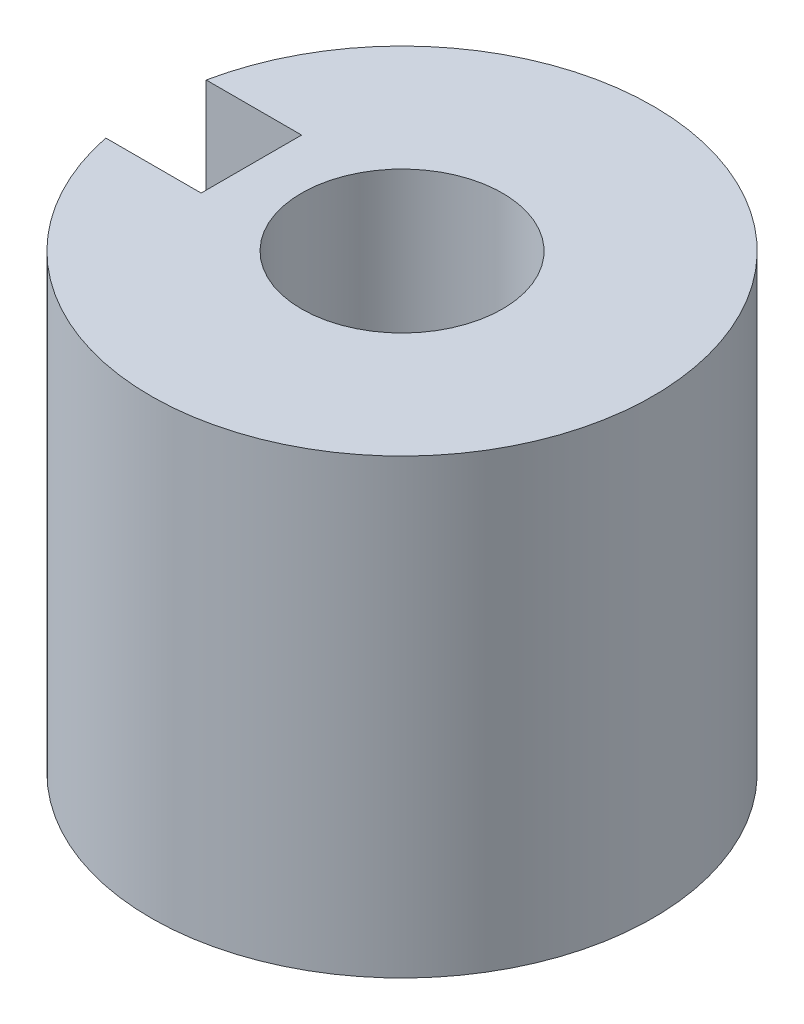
from build123d import *

# Parameters (mm, degrees)
SKETCH1_R           = 2.5
SKETCH1_R_2         = 1
BOSS_EXTRUDE1_DEPTH = 4.5
SKETCH2_W           = 1
SKETCH2_H           = 1.5
CUT_EXTRUDE1_DEPTH  = 1


with BuildPart() as part:
    # Sketch1 → Boss-Extrude1 (new body)
    with BuildSketch(Plane(origin=(0, 0, 0), x_dir=(1, 0, 0), z_dir=(0, 1, 0))):
        with Locations(Location((2.5, 0, 0), (0, 0, 270))):
            Circle(SKETCH1_R)
        with Locations(Location((2.5, 0, 0), (0, 0, 270))):
            Circle(SKETCH1_R_2, mode=Mode.SUBTRACT)
    extrude(amount=BOSS_EXTRUDE1_DEPTH)

    # Sketch2 → Cut-Extrude1 (cut)
    with BuildSketch(Plane(origin=(0, 0, 0), x_dir=(0, 0, -1), z_dir=(1, 0, 0))):
        with Locations((0, 0.75)):
            Rectangle(SKETCH2_W, SKETCH2_H)
        with Locations((0, 3.75)):
            Rectangle(SKETCH2_W, SKETCH2_H)
    extrude(amount=CUT_EXTRUDE1_DEPTH, mode=Mode.SUBTRACT)


solid = part.part
